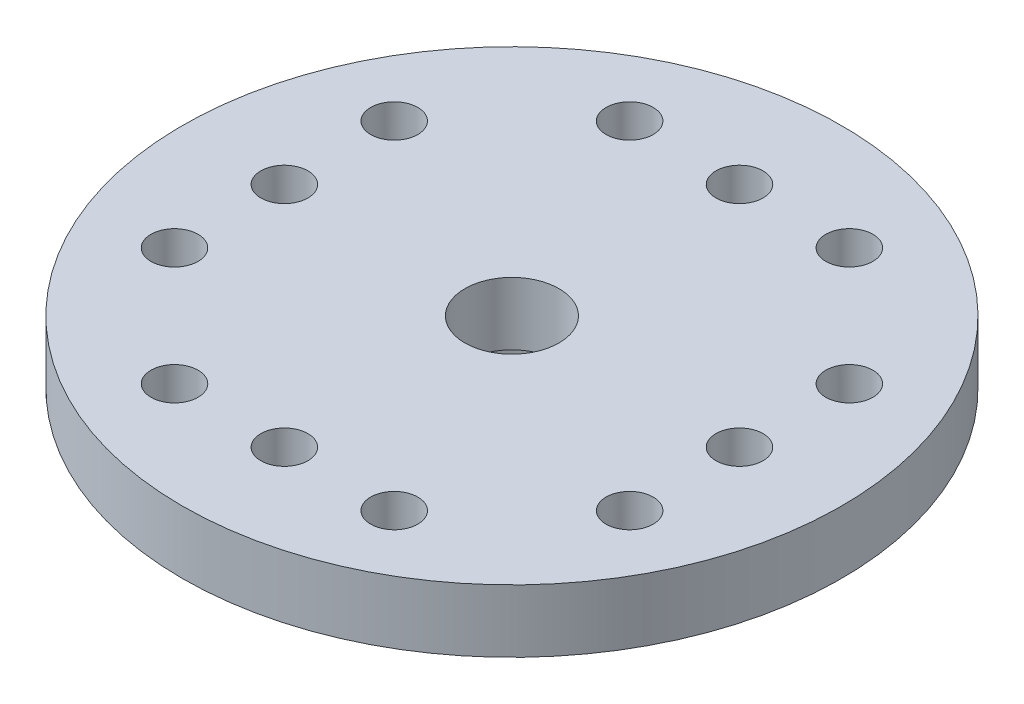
ISO-10303-21;
HEADER;
FILE_DESCRIPTION(('STEP AP214'),'2;1');
FILE_NAME('part.step','',(''),(''),'','','');
FILE_SCHEMA(('AUTOMOTIVE_DESIGN { 1 0 10303 214 1 1 1 1 }'));
ENDSEC;
DATA;
#1=APPLICATION_CONTEXT('core data for automotive mechanical design processes');
#2=APPLICATION_PROTOCOL_DEFINITION('international standard','automotive_design',2000,#1);
#3=PRODUCT_CONTEXT('',#1,'mechanical');
#4=PRODUCT('Part','Part','',(#3));
#5=PRODUCT_RELATED_PRODUCT_CATEGORY('part','',(#4));
#6=PRODUCT_DEFINITION_FORMATION('','',#4);
#7=PRODUCT_DEFINITION_CONTEXT('part definition',#1,'design');
#8=PRODUCT_DEFINITION('design','',#6,#7);
#9=PRODUCT_DEFINITION_SHAPE('','',#8);
#10=(LENGTH_UNIT() NAMED_UNIT(*) SI_UNIT(.MILLI.,.METRE.));
#11=(NAMED_UNIT(*) PLANE_ANGLE_UNIT() SI_UNIT($,.RADIAN.));
#12=(NAMED_UNIT(*) SI_UNIT($,.STERADIAN.) SOLID_ANGLE_UNIT());
#13=UNCERTAINTY_MEASURE_WITH_UNIT(LENGTH_MEASURE(1.E-05),#10,'distance_accuracy_value','');
#14=(GEOMETRIC_REPRESENTATION_CONTEXT(3) GLOBAL_UNCERTAINTY_ASSIGNED_CONTEXT((#13)) GLOBAL_UNIT_ASSIGNED_CONTEXT((#10,
#11,#12)) REPRESENTATION_CONTEXT('',''));
#15=CARTESIAN_POINT('',(0.,0.,0.));
#16=DIRECTION('',(0.,0.,1.));
#17=DIRECTION('',(1.,0.,0.));
#18=AXIS2_PLACEMENT_3D('',#15,#16,#17);
#19=CARTESIAN_POINT('',(0.,-2.,0.));
#20=DIRECTION('',(0.,1.,0.));
#21=DIRECTION('',(0.,0.,1.));
#22=AXIS2_PLACEMENT_3D('',#19,#20,#21);
#23=PLANE('',#22);
#24=CARTESIAN_POINT('',(3.5,-2.,7.25));
#25=DIRECTION('',(0.,1.,0.));
#26=DIRECTION('',(0.,0.,1.));
#27=AXIS2_PLACEMENT_3D('',#24,#25,#26);
#28=CIRCLE('',#27,0.750000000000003);
#29=CARTESIAN_POINT('',(3.5,-2.,8.));
#30=VERTEX_POINT('',#29);
#31=EDGE_CURVE('E147',#30,#30,#28,.T.);
#32=ORIENTED_EDGE('',*,*,#31,.T.);
#33=EDGE_LOOP('',(#32));
#34=FACE_BOUND('',#33,.T.);
#35=CARTESIAN_POINT('',(-3.5,-2.,7.25));
#36=DIRECTION('',(0.,1.,0.));
#37=DIRECTION('',(0.,0.,1.));
#38=AXIS2_PLACEMENT_3D('',#35,#36,#37);
#39=CIRCLE('',#38,0.75);
#40=CARTESIAN_POINT('',(-3.5,-2.,8.));
#41=VERTEX_POINT('',#40);
#42=EDGE_CURVE('E141',#41,#41,#39,.T.);
#43=ORIENTED_EDGE('',*,*,#42,.T.);
#44=EDGE_LOOP('',(#43));
#45=FACE_BOUND('',#44,.T.);
#46=CARTESIAN_POINT('',(0.,-2.,7.25));
#47=DIRECTION('',(0.,1.,0.));
#48=DIRECTION('',(0.,0.,1.));
#49=AXIS2_PLACEMENT_3D('',#46,#47,#48);
#50=CIRCLE('',#49,0.75);
#51=CARTESIAN_POINT('',(0.,-2.,8.));
#52=VERTEX_POINT('',#51);
#53=EDGE_CURVE('E135',#52,#52,#50,.T.);
#54=ORIENTED_EDGE('',*,*,#53,.T.);
#55=EDGE_LOOP('',(#54));
#56=FACE_BOUND('',#55,.T.);
#57=CARTESIAN_POINT('',(7.25,-2.,0.));
#58=DIRECTION('',(0.,1.,0.));
#59=DIRECTION('',(0.,0.,1.));
#60=AXIS2_PLACEMENT_3D('',#57,#58,#59);
#61=CIRCLE('',#60,0.750000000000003);
#62=CARTESIAN_POINT('',(7.25,-2.,0.749999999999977));
#63=VERTEX_POINT('',#62);
#64=EDGE_CURVE('E128',#63,#63,#61,.T.);
#65=ORIENTED_EDGE('',*,*,#64,.T.);
#66=EDGE_LOOP('',(#65));
#67=FACE_BOUND('',#66,.T.);
#68=CARTESIAN_POINT('',(7.24999999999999,-2.,-3.50000000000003));
#69=DIRECTION('',(0.,1.,0.));
#70=DIRECTION('',(0.,0.,1.));
#71=AXIS2_PLACEMENT_3D('',#68,#69,#70);
#72=CIRCLE('',#71,0.750000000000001);
#73=CARTESIAN_POINT('',(7.24999999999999,-2.,-2.75000000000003));
#74=VERTEX_POINT('',#73);
#75=EDGE_CURVE('E120',#74,#74,#72,.T.);
#76=ORIENTED_EDGE('',*,*,#75,.T.);
#77=EDGE_LOOP('',(#76));
#78=FACE_BOUND('',#77,.T.);
#79=CARTESIAN_POINT('',(7.25000000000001,-2.,3.49999999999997));
#80=DIRECTION('',(0.,1.,0.));
#81=DIRECTION('',(0.,0.,1.));
#82=AXIS2_PLACEMENT_3D('',#79,#80,#81);
#83=CIRCLE('',#82,0.75);
#84=CARTESIAN_POINT('',(7.25000000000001,-2.,4.24999999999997));
#85=VERTEX_POINT('',#84);
#86=EDGE_CURVE('E113',#85,#85,#83,.T.);
#87=ORIENTED_EDGE('',*,*,#86,.T.);
#88=EDGE_LOOP('',(#87));
#89=FACE_BOUND('',#88,.T.);
#90=CARTESIAN_POINT('',(-7.25,-2.,0.));
#91=DIRECTION('',(0.,1.,0.));
#92=DIRECTION('',(0.,0.,1.));
#93=AXIS2_PLACEMENT_3D('',#90,#91,#92);
#94=CIRCLE('',#93,0.750000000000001);
#95=CARTESIAN_POINT('',(-7.25,-2.,0.750000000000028));
#96=VERTEX_POINT('',#95);
#97=EDGE_CURVE('E107',#96,#96,#94,.T.);
#98=ORIENTED_EDGE('',*,*,#97,.T.);
#99=EDGE_LOOP('',(#98));
#100=FACE_BOUND('',#99,.T.);
#101=CARTESIAN_POINT('',(-7.24999999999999,-2.,3.50000000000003));
#102=DIRECTION('',(0.,1.,0.));
#103=DIRECTION('',(0.,0.,1.));
#104=AXIS2_PLACEMENT_3D('',#101,#102,#103);
#105=CIRCLE('',#104,0.75);
#106=CARTESIAN_POINT('',(-7.24999999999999,-2.,4.25000000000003));
#107=VERTEX_POINT('',#106);
#108=EDGE_CURVE('E101',#107,#107,#105,.T.);
#109=ORIENTED_EDGE('',*,*,#108,.T.);
#110=EDGE_LOOP('',(#109));
#111=FACE_BOUND('',#110,.T.);
#112=CARTESIAN_POINT('',(-7.25000000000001,-2.,-3.49999999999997));
#113=DIRECTION('',(0.,1.,0.));
#114=DIRECTION('',(0.,0.,1.));
#115=AXIS2_PLACEMENT_3D('',#112,#113,#114);
#116=CIRCLE('',#115,0.750000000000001);
#117=CARTESIAN_POINT('',(-7.25000000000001,-2.,-2.74999999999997));
#118=VERTEX_POINT('',#117);
#119=EDGE_CURVE('E95',#118,#118,#116,.T.);
#120=ORIENTED_EDGE('',*,*,#119,.T.);
#121=EDGE_LOOP('',(#120));
#122=FACE_BOUND('',#121,.T.);
#123=CARTESIAN_POINT('',(-3.5,-2.,-7.25));
#124=DIRECTION('',(0.,1.,0.));
#125=DIRECTION('',(0.,0.,1.));
#126=AXIS2_PLACEMENT_3D('',#123,#124,#125);
#127=CIRCLE('',#126,0.75);
#128=CARTESIAN_POINT('',(-3.5,-2.,-6.5));
#129=VERTEX_POINT('',#128);
#130=EDGE_CURVE('E89',#129,#129,#127,.T.);
#131=ORIENTED_EDGE('',*,*,#130,.T.);
#132=EDGE_LOOP('',(#131));
#133=FACE_BOUND('',#132,.T.);
#134=CARTESIAN_POINT('',(3.5,-2.,-7.25));
#135=DIRECTION('',(0.,1.,0.));
#136=DIRECTION('',(0.,0.,1.));
#137=AXIS2_PLACEMENT_3D('',#134,#135,#136);
#138=CIRCLE('',#137,0.75);
#139=CARTESIAN_POINT('',(3.5,-2.,-6.5));
#140=VERTEX_POINT('',#139);
#141=EDGE_CURVE('E83',#140,#140,#138,.T.);
#142=ORIENTED_EDGE('',*,*,#141,.T.);
#143=EDGE_LOOP('',(#142));
#144=FACE_BOUND('',#143,.T.);
#145=CARTESIAN_POINT('',(0.,-2.,-7.25));
#146=DIRECTION('',(0.,1.,0.));
#147=DIRECTION('',(0.,0.,1.));
#148=AXIS2_PLACEMENT_3D('',#145,#146,#147);
#149=CIRCLE('',#148,0.750000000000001);
#150=CARTESIAN_POINT('',(0.,-2.,-6.5));
#151=VERTEX_POINT('',#150);
#152=EDGE_CURVE('E74',#151,#151,#149,.T.);
#153=ORIENTED_EDGE('',*,*,#152,.T.);
#154=EDGE_LOOP('',(#153));
#155=FACE_BOUND('',#154,.T.);
#156=CARTESIAN_POINT('',(0.,-2.,0.));
#157=DIRECTION('',(0.,1.,0.));
#158=DIRECTION('',(0.,0.,1.));
#159=AXIS2_PLACEMENT_3D('',#156,#157,#158);
#160=CIRCLE('',#159,10.5);
#161=CARTESIAN_POINT('',(0.,-2.,10.5));
#162=VERTEX_POINT('',#161);
#163=EDGE_CURVE('E42',#162,#162,#160,.T.);
#164=ORIENTED_EDGE('',*,*,#163,.F.);
#165=EDGE_LOOP('',(#164));
#166=FACE_BOUND('',#165,.T.);
#167=CARTESIAN_POINT('',(0.,-2.,0.));
#168=DIRECTION('',(0.,1.,0.));
#169=DIRECTION('',(0.,0.,1.));
#170=AXIS2_PLACEMENT_3D('',#167,#168,#169);
#171=CIRCLE('',#170,4.4);
#172=CARTESIAN_POINT('',(0.,-2.,4.4));
#173=VERTEX_POINT('',#172);
#174=EDGE_CURVE('E10',#173,#173,#171,.F.);
#175=ORIENTED_EDGE('',*,*,#174,.F.);
#176=EDGE_LOOP('',(#175));
#177=FACE_BOUND('',#176,.T.);
#178=ADVANCED_FACE('F34',(#34,#45,#56,#67,#78,#89,#100,#111,#122,#133,#144,#155,#166,#177),#23,.F.);
#179=CARTESIAN_POINT('',(0.,-2.,0.));
#180=DIRECTION('',(0.,1.,0.));
#181=DIRECTION('',(0.,0.,1.));
#182=AXIS2_PLACEMENT_3D('',#179,#180,#181);
#183=CYLINDRICAL_SURFACE('',#182,10.5);
#184=ORIENTED_EDGE('',*,*,#163,.T.);
#185=EDGE_LOOP('',(#184));
#186=FACE_BOUND('',#185,.T.);
#187=CARTESIAN_POINT('',(0.,0.,0.));
#188=DIRECTION('',(0.,1.,0.));
#189=DIRECTION('',(0.,0.,1.));
#190=AXIS2_PLACEMENT_3D('',#187,#188,#189);
#191=CIRCLE('',#190,10.5);
#192=CARTESIAN_POINT('',(0.,0.,10.5));
#193=VERTEX_POINT('',#192);
#194=EDGE_CURVE('E49',#193,#193,#191,.T.);
#195=ORIENTED_EDGE('',*,*,#194,.F.);
#196=EDGE_LOOP('',(#195));
#197=FACE_BOUND('',#196,.T.);
#198=ADVANCED_FACE('F36',(#186,#197),#183,.T.);
#199=CARTESIAN_POINT('',(0.,-2.,0.));
#200=DIRECTION('',(0.,-1.,0.));
#201=DIRECTION('',(0.,0.,-1.));
#202=AXIS2_PLACEMENT_3D('',#199,#200,#201);
#203=CIRCLE('',#202,3.);
#204=CARTESIAN_POINT('',(0.,-2.,-3.));
#205=VERTEX_POINT('',#204);
#206=EDGE_CURVE('E71',#205,#205,#203,.T.);
#207=ORIENTED_EDGE('',*,*,#206,.T.);
#208=EDGE_LOOP('',(#207));
#209=FACE_BOUND('',#208,.T.);
#210=CARTESIAN_POINT('',(0.,-2.,0.));
#211=DIRECTION('',(0.,1.,0.));
#212=DIRECTION('',(0.,0.,1.));
#213=AXIS2_PLACEMENT_3D('',#210,#211,#212);
#214=CIRCLE('',#213,1.5);
#215=CARTESIAN_POINT('',(0.,-2.,1.5));
#216=VERTEX_POINT('',#215);
#217=EDGE_CURVE('E57',#216,#216,#214,.T.);
#218=ORIENTED_EDGE('',*,*,#217,.T.);
#219=EDGE_LOOP('',(#218));
#220=FACE_BOUND('',#219,.T.);
#221=ADVANCED_FACE('F162',(#209,#220),#23,.F.);
#222=CARTESIAN_POINT('',(0.,0.,0.));
#223=DIRECTION('',(0.,1.,0.));
#224=DIRECTION('',(0.,0.,1.));
#225=AXIS2_PLACEMENT_3D('',#222,#223,#224);
#226=PLANE('',#225);
#227=CARTESIAN_POINT('',(3.5,0.,7.25));
#228=DIRECTION('',(0.,1.,0.));
#229=DIRECTION('',(0.,0.,1.));
#230=AXIS2_PLACEMENT_3D('',#227,#228,#229);
#231=CIRCLE('',#230,0.750000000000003);
#232=CARTESIAN_POINT('',(3.5,0.,8.));
#233=VERTEX_POINT('',#232);
#234=EDGE_CURVE('E151',#233,#233,#231,.T.);
#235=ORIENTED_EDGE('',*,*,#234,.F.);
#236=EDGE_LOOP('',(#235));
#237=FACE_BOUND('',#236,.T.);
#238=CARTESIAN_POINT('',(-3.5,0.,7.25));
#239=DIRECTION('',(0.,1.,0.));
#240=DIRECTION('',(0.,0.,1.));
#241=AXIS2_PLACEMENT_3D('',#238,#239,#240);
#242=CIRCLE('',#241,0.75);
#243=CARTESIAN_POINT('',(-3.5,0.,8.));
#244=VERTEX_POINT('',#243);
#245=EDGE_CURVE('E144',#244,#244,#242,.T.);
#246=ORIENTED_EDGE('',*,*,#245,.F.);
#247=EDGE_LOOP('',(#246));
#248=FACE_BOUND('',#247,.T.);
#249=CARTESIAN_POINT('',(0.,0.,7.25));
#250=DIRECTION('',(0.,1.,0.));
#251=DIRECTION('',(0.,0.,1.));
#252=AXIS2_PLACEMENT_3D('',#249,#250,#251);
#253=CIRCLE('',#252,0.75);
#254=CARTESIAN_POINT('',(0.,0.,8.));
#255=VERTEX_POINT('',#254);
#256=EDGE_CURVE('E138',#255,#255,#253,.T.);
#257=ORIENTED_EDGE('',*,*,#256,.F.);
#258=EDGE_LOOP('',(#257));
#259=FACE_BOUND('',#258,.T.);
#260=CARTESIAN_POINT('',(7.25,0.,0.));
#261=DIRECTION('',(0.,1.,0.));
#262=DIRECTION('',(0.,0.,-1.));
#263=AXIS2_PLACEMENT_3D('',#260,#261,#262);
#264=CIRCLE('',#263,0.750000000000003);
#265=CARTESIAN_POINT('',(7.25,0.,-0.750000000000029));
#266=VERTEX_POINT('',#265);
#267=EDGE_CURVE('E131',#266,#266,#264,.T.);
#268=ORIENTED_EDGE('',*,*,#267,.F.);
#269=EDGE_LOOP('',(#268));
#270=FACE_BOUND('',#269,.T.);
#271=CARTESIAN_POINT('',(7.24999999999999,0.,-3.50000000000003));
#272=DIRECTION('',(0.,1.,0.));
#273=DIRECTION('',(0.,0.,-1.));
#274=AXIS2_PLACEMENT_3D('',#271,#272,#273);
#275=CIRCLE('',#274,0.750000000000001);
#276=CARTESIAN_POINT('',(7.24999999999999,0.,-4.25000000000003));
#277=VERTEX_POINT('',#276);
#278=EDGE_CURVE('E124',#277,#277,#275,.T.);
#279=ORIENTED_EDGE('',*,*,#278,.F.);
#280=EDGE_LOOP('',(#279));
#281=FACE_BOUND('',#280,.T.);
#282=CARTESIAN_POINT('',(7.25000000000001,0.,3.49999999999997));
#283=DIRECTION('',(0.,1.,0.));
#284=DIRECTION('',(0.,0.,-1.));
#285=AXIS2_PLACEMENT_3D('',#282,#283,#284);
#286=CIRCLE('',#285,0.75);
#287=CARTESIAN_POINT('',(7.25000000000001,0.,2.74999999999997));
#288=VERTEX_POINT('',#287);
#289=EDGE_CURVE('E116',#288,#288,#286,.T.);
#290=ORIENTED_EDGE('',*,*,#289,.F.);
#291=EDGE_LOOP('',(#290));
#292=FACE_BOUND('',#291,.T.);
#293=CARTESIAN_POINT('',(-7.25,0.,0.));
#294=DIRECTION('',(0.,1.,0.));
#295=DIRECTION('',(0.,0.,-1.));
#296=AXIS2_PLACEMENT_3D('',#293,#294,#295);
#297=CIRCLE('',#296,0.750000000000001);
#298=CARTESIAN_POINT('',(-7.25,0.,-0.749999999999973));
#299=VERTEX_POINT('',#298);
#300=EDGE_CURVE('E110',#299,#299,#297,.T.);
#301=ORIENTED_EDGE('',*,*,#300,.F.);
#302=EDGE_LOOP('',(#301));
#303=FACE_BOUND('',#302,.T.);
#304=CARTESIAN_POINT('',(-7.24999999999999,0.,3.50000000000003));
#305=DIRECTION('',(0.,1.,0.));
#306=DIRECTION('',(0.,0.,-1.));
#307=AXIS2_PLACEMENT_3D('',#304,#305,#306);
#308=CIRCLE('',#307,0.75);
#309=CARTESIAN_POINT('',(-7.24999999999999,0.,2.75000000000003));
#310=VERTEX_POINT('',#309);
#311=EDGE_CURVE('E104',#310,#310,#308,.T.);
#312=ORIENTED_EDGE('',*,*,#311,.F.);
#313=EDGE_LOOP('',(#312));
#314=FACE_BOUND('',#313,.T.);
#315=CARTESIAN_POINT('',(-7.25000000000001,0.,-3.49999999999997));
#316=DIRECTION('',(0.,1.,0.));
#317=DIRECTION('',(0.,0.,-1.));
#318=AXIS2_PLACEMENT_3D('',#315,#316,#317);
#319=CIRCLE('',#318,0.750000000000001);
#320=CARTESIAN_POINT('',(-7.25000000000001,0.,-4.24999999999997));
#321=VERTEX_POINT('',#320);
#322=EDGE_CURVE('E98',#321,#321,#319,.T.);
#323=ORIENTED_EDGE('',*,*,#322,.F.);
#324=EDGE_LOOP('',(#323));
#325=FACE_BOUND('',#324,.T.);
#326=CARTESIAN_POINT('',(-3.5,0.,-7.25));
#327=DIRECTION('',(0.,1.,0.));
#328=DIRECTION('',(0.,0.,1.));
#329=AXIS2_PLACEMENT_3D('',#326,#327,#328);
#330=CIRCLE('',#329,0.75);
#331=CARTESIAN_POINT('',(-3.5,0.,-6.5));
#332=VERTEX_POINT('',#331);
#333=EDGE_CURVE('E92',#332,#332,#330,.T.);
#334=ORIENTED_EDGE('',*,*,#333,.F.);
#335=EDGE_LOOP('',(#334));
#336=FACE_BOUND('',#335,.T.);
#337=CARTESIAN_POINT('',(3.5,0.,-7.25));
#338=DIRECTION('',(0.,1.,0.));
#339=DIRECTION('',(0.,0.,1.));
#340=AXIS2_PLACEMENT_3D('',#337,#338,#339);
#341=CIRCLE('',#340,0.75);
#342=CARTESIAN_POINT('',(3.5,0.,-6.5));
#343=VERTEX_POINT('',#342);
#344=EDGE_CURVE('E86',#343,#343,#341,.T.);
#345=ORIENTED_EDGE('',*,*,#344,.F.);
#346=EDGE_LOOP('',(#345));
#347=FACE_BOUND('',#346,.T.);
#348=CARTESIAN_POINT('',(0.,0.,-7.25));
#349=DIRECTION('',(0.,1.,0.));
#350=DIRECTION('',(0.,0.,1.));
#351=AXIS2_PLACEMENT_3D('',#348,#349,#350);
#352=CIRCLE('',#351,0.750000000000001);
#353=CARTESIAN_POINT('',(0.,0.,-6.5));
#354=VERTEX_POINT('',#353);
#355=EDGE_CURVE('E80',#354,#354,#352,.T.);
#356=ORIENTED_EDGE('',*,*,#355,.F.);
#357=EDGE_LOOP('',(#356));
#358=FACE_BOUND('',#357,.T.);
#359=CARTESIAN_POINT('',(0.,0.,0.));
#360=DIRECTION('',(0.,1.,0.));
#361=DIRECTION('',(0.,0.,1.));
#362=AXIS2_PLACEMENT_3D('',#359,#360,#361);
#363=CIRCLE('',#362,1.5);
#364=CARTESIAN_POINT('',(0.,0.,1.5));
#365=VERTEX_POINT('',#364);
#366=EDGE_CURVE('E59',#365,#365,#363,.T.);
#367=ORIENTED_EDGE('',*,*,#366,.F.);
#368=EDGE_LOOP('',(#367));
#369=FACE_BOUND('',#368,.T.);
#370=ORIENTED_EDGE('',*,*,#194,.T.);
#371=EDGE_LOOP('',(#370));
#372=FACE_BOUND('',#371,.T.);
#373=ADVANCED_FACE('F158',(#237,#248,#259,#270,#281,#292,#303,#314,#325,#336,#347,#358,#369,
#372),#226,.T.);
#374=CARTESIAN_POINT('',(0.,-2.,0.));
#375=DIRECTION('',(0.,1.,0.));
#376=DIRECTION('',(0.,0.,1.));
#377=AXIS2_PLACEMENT_3D('',#374,#375,#376);
#378=CYLINDRICAL_SURFACE('',#377,1.5);
#379=ORIENTED_EDGE('',*,*,#217,.F.);
#380=EDGE_LOOP('',(#379));
#381=FACE_BOUND('',#380,.T.);
#382=ORIENTED_EDGE('',*,*,#366,.T.);
#383=EDGE_LOOP('',(#382));
#384=FACE_BOUND('',#383,.T.);
#385=ADVANCED_FACE('F161',(#381,#384),#378,.F.);
#386=CARTESIAN_POINT('',(0.,-5.7,0.));
#387=DIRECTION('',(0.,-1.,0.));
#388=DIRECTION('',(0.,0.,-1.));
#389=AXIS2_PLACEMENT_3D('',#386,#387,#388);
#390=PLANE('',#389);
#391=CARTESIAN_POINT('',(0.,-5.7,0.));
#392=DIRECTION('',(0.,-1.,0.));
#393=DIRECTION('',(0.,0.,-1.));
#394=AXIS2_PLACEMENT_3D('',#391,#392,#393);
#395=CIRCLE('',#394,4.4);
#396=CARTESIAN_POINT('',(0.,-5.7,-4.4));
#397=VERTEX_POINT('',#396);
#398=EDGE_CURVE('E63',#397,#397,#395,.T.);
#399=ORIENTED_EDGE('',*,*,#398,.T.);
#400=EDGE_LOOP('',(#399));
#401=FACE_BOUND('',#400,.T.);
#402=CARTESIAN_POINT('',(0.,-5.7,0.));
#403=DIRECTION('',(0.,-1.,0.));
#404=DIRECTION('',(0.,0.,-1.));
#405=AXIS2_PLACEMENT_3D('',#402,#403,#404);
#406=CIRCLE('',#405,3.);
#407=CARTESIAN_POINT('',(0.,-5.7,-3.));
#408=VERTEX_POINT('',#407);
#409=EDGE_CURVE('E70',#408,#408,#406,.T.);
#410=ORIENTED_EDGE('',*,*,#409,.F.);
#411=EDGE_LOOP('',(#410));
#412=FACE_BOUND('',#411,.T.);
#413=ADVANCED_FACE('F203',(#401,#412),#390,.T.);
#414=CARTESIAN_POINT('',(0.,-5.7,0.));
#415=DIRECTION('',(0.,1.,0.));
#416=DIRECTION('',(0.,0.,1.));
#417=AXIS2_PLACEMENT_3D('',#414,#415,#416);
#418=CYLINDRICAL_SURFACE('',#417,4.4);
#419=ORIENTED_EDGE('',*,*,#398,.F.);
#420=EDGE_LOOP('',(#419));
#421=FACE_BOUND('',#420,.T.);
#422=ORIENTED_EDGE('',*,*,#174,.T.);
#423=EDGE_LOOP('',(#422));
#424=FACE_BOUND('',#423,.T.);
#425=ADVANCED_FACE('F205',(#421,#424),#418,.T.);
#426=CARTESIAN_POINT('',(0.,-5.7,0.));
#427=DIRECTION('',(0.,1.,0.));
#428=DIRECTION('',(0.,0.,1.));
#429=AXIS2_PLACEMENT_3D('',#426,#427,#428);
#430=CYLINDRICAL_SURFACE('',#429,3.);
#431=ORIENTED_EDGE('',*,*,#409,.T.);
#432=EDGE_LOOP('',(#431));
#433=FACE_BOUND('',#432,.T.);
#434=ORIENTED_EDGE('',*,*,#206,.F.);
#435=EDGE_LOOP('',(#434));
#436=FACE_BOUND('',#435,.T.);
#437=ADVANCED_FACE('F208',(#433,#436),#430,.F.);
#438=CARTESIAN_POINT('',(0.,-10.,-7.25));
#439=DIRECTION('',(0.,1.,0.));
#440=DIRECTION('',(0.,0.,1.));
#441=AXIS2_PLACEMENT_3D('',#438,#439,#440);
#442=CYLINDRICAL_SURFACE('',#441,0.750000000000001);
#443=ORIENTED_EDGE('',*,*,#355,.T.);
#444=EDGE_LOOP('',(#443));
#445=FACE_BOUND('',#444,.T.);
#446=ORIENTED_EDGE('',*,*,#152,.F.);
#447=EDGE_LOOP('',(#446));
#448=FACE_BOUND('',#447,.T.);
#449=ADVANCED_FACE('F215',(#445,#448),#442,.F.);
#450=CARTESIAN_POINT('',(3.5,-10.,-7.25));
#451=DIRECTION('',(0.,1.,0.));
#452=DIRECTION('',(0.,0.,1.));
#453=AXIS2_PLACEMENT_3D('',#450,#451,#452);
#454=CYLINDRICAL_SURFACE('',#453,0.75);
#455=ORIENTED_EDGE('',*,*,#344,.T.);
#456=EDGE_LOOP('',(#455));
#457=FACE_BOUND('',#456,.T.);
#458=ORIENTED_EDGE('',*,*,#141,.F.);
#459=EDGE_LOOP('',(#458));
#460=FACE_BOUND('',#459,.T.);
#461=ADVANCED_FACE('F219',(#457,#460),#454,.F.);
#462=CARTESIAN_POINT('',(-3.5,-10.,-7.25));
#463=DIRECTION('',(0.,1.,0.));
#464=DIRECTION('',(0.,0.,1.));
#465=AXIS2_PLACEMENT_3D('',#462,#463,#464);
#466=CYLINDRICAL_SURFACE('',#465,0.75);
#467=ORIENTED_EDGE('',*,*,#333,.T.);
#468=EDGE_LOOP('',(#467));
#469=FACE_BOUND('',#468,.T.);
#470=ORIENTED_EDGE('',*,*,#130,.F.);
#471=EDGE_LOOP('',(#470));
#472=FACE_BOUND('',#471,.T.);
#473=ADVANCED_FACE('F223',(#469,#472),#466,.F.);
#474=CARTESIAN_POINT('',(-7.25000000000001,-10.,-3.49999999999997));
#475=DIRECTION('',(0.,1.,0.));
#476=DIRECTION('',(0.,0.,1.));
#477=AXIS2_PLACEMENT_3D('',#474,#475,#476);
#478=CYLINDRICAL_SURFACE('',#477,0.750000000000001);
#479=ORIENTED_EDGE('',*,*,#322,.T.);
#480=EDGE_LOOP('',(#479));
#481=FACE_BOUND('',#480,.T.);
#482=ORIENTED_EDGE('',*,*,#119,.F.);
#483=EDGE_LOOP('',(#482));
#484=FACE_BOUND('',#483,.T.);
#485=ADVANCED_FACE('F227',(#481,#484),#478,.F.);
#486=CARTESIAN_POINT('',(-7.24999999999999,-10.,3.50000000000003));
#487=DIRECTION('',(0.,1.,0.));
#488=DIRECTION('',(0.,0.,1.));
#489=AXIS2_PLACEMENT_3D('',#486,#487,#488);
#490=CYLINDRICAL_SURFACE('',#489,0.75);
#491=ORIENTED_EDGE('',*,*,#311,.T.);
#492=EDGE_LOOP('',(#491));
#493=FACE_BOUND('',#492,.T.);
#494=ORIENTED_EDGE('',*,*,#108,.F.);
#495=EDGE_LOOP('',(#494));
#496=FACE_BOUND('',#495,.T.);
#497=ADVANCED_FACE('F231',(#493,#496),#490,.F.);
#498=CARTESIAN_POINT('',(-7.25,-10.,0.));
#499=DIRECTION('',(0.,1.,0.));
#500=DIRECTION('',(0.,0.,1.));
#501=AXIS2_PLACEMENT_3D('',#498,#499,#500);
#502=CYLINDRICAL_SURFACE('',#501,0.750000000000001);
#503=ORIENTED_EDGE('',*,*,#300,.T.);
#504=EDGE_LOOP('',(#503));
#505=FACE_BOUND('',#504,.T.);
#506=ORIENTED_EDGE('',*,*,#97,.F.);
#507=EDGE_LOOP('',(#506));
#508=FACE_BOUND('',#507,.T.);
#509=ADVANCED_FACE('F235',(#505,#508),#502,.F.);
#510=CARTESIAN_POINT('',(7.25000000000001,-10.,3.49999999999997));
#511=DIRECTION('',(0.,1.,0.));
#512=DIRECTION('',(0.,0.,1.));
#513=AXIS2_PLACEMENT_3D('',#510,#511,#512);
#514=CYLINDRICAL_SURFACE('',#513,0.75);
#515=ORIENTED_EDGE('',*,*,#289,.T.);
#516=EDGE_LOOP('',(#515));
#517=FACE_BOUND('',#516,.T.);
#518=ORIENTED_EDGE('',*,*,#86,.F.);
#519=EDGE_LOOP('',(#518));
#520=FACE_BOUND('',#519,.T.);
#521=ADVANCED_FACE('F239',(#517,#520),#514,.F.);
#522=CARTESIAN_POINT('',(7.24999999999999,-10.,-3.50000000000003));
#523=DIRECTION('',(0.,1.,0.));
#524=DIRECTION('',(0.,0.,1.));
#525=AXIS2_PLACEMENT_3D('',#522,#523,#524);
#526=CYLINDRICAL_SURFACE('',#525,0.750000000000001);
#527=ORIENTED_EDGE('',*,*,#278,.T.);
#528=EDGE_LOOP('',(#527));
#529=FACE_BOUND('',#528,.T.);
#530=ORIENTED_EDGE('',*,*,#75,.F.);
#531=EDGE_LOOP('',(#530));
#532=FACE_BOUND('',#531,.T.);
#533=ADVANCED_FACE('F243',(#529,#532),#526,.F.);
#534=CARTESIAN_POINT('',(7.25,-10.,0.));
#535=DIRECTION('',(0.,1.,0.));
#536=DIRECTION('',(0.,0.,1.));
#537=AXIS2_PLACEMENT_3D('',#534,#535,#536);
#538=CYLINDRICAL_SURFACE('',#537,0.750000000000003);
#539=ORIENTED_EDGE('',*,*,#267,.T.);
#540=EDGE_LOOP('',(#539));
#541=FACE_BOUND('',#540,.T.);
#542=ORIENTED_EDGE('',*,*,#64,.F.);
#543=EDGE_LOOP('',(#542));
#544=FACE_BOUND('',#543,.T.);
#545=ADVANCED_FACE('F247',(#541,#544),#538,.F.);
#546=CARTESIAN_POINT('',(0.,-10.,7.25));
#547=DIRECTION('',(0.,1.,0.));
#548=DIRECTION('',(0.,0.,1.));
#549=AXIS2_PLACEMENT_3D('',#546,#547,#548);
#550=CYLINDRICAL_SURFACE('',#549,0.75);
#551=ORIENTED_EDGE('',*,*,#256,.T.);
#552=EDGE_LOOP('',(#551));
#553=FACE_BOUND('',#552,.T.);
#554=ORIENTED_EDGE('',*,*,#53,.F.);
#555=EDGE_LOOP('',(#554));
#556=FACE_BOUND('',#555,.T.);
#557=ADVANCED_FACE('F251',(#553,#556),#550,.F.);
#558=CARTESIAN_POINT('',(-3.5,-10.,7.25));
#559=DIRECTION('',(0.,1.,0.));
#560=DIRECTION('',(0.,0.,1.));
#561=AXIS2_PLACEMENT_3D('',#558,#559,#560);
#562=CYLINDRICAL_SURFACE('',#561,0.75);
#563=ORIENTED_EDGE('',*,*,#245,.T.);
#564=EDGE_LOOP('',(#563));
#565=FACE_BOUND('',#564,.T.);
#566=ORIENTED_EDGE('',*,*,#42,.F.);
#567=EDGE_LOOP('',(#566));
#568=FACE_BOUND('',#567,.T.);
#569=ADVANCED_FACE('F255',(#565,#568),#562,.F.);
#570=CARTESIAN_POINT('',(3.5,-10.,7.25));
#571=DIRECTION('',(0.,1.,0.));
#572=DIRECTION('',(0.,0.,1.));
#573=AXIS2_PLACEMENT_3D('',#570,#571,#572);
#574=CYLINDRICAL_SURFACE('',#573,0.750000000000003);
#575=ORIENTED_EDGE('',*,*,#234,.T.);
#576=EDGE_LOOP('',(#575));
#577=FACE_BOUND('',#576,.T.);
#578=ORIENTED_EDGE('',*,*,#31,.F.);
#579=EDGE_LOOP('',(#578));
#580=FACE_BOUND('',#579,.T.);
#581=ADVANCED_FACE('F155',(#577,#580),#574,.F.);
#582=CLOSED_SHELL('',(#178,#198,#221,#373,#385,#413,#425,#437,#449,#461,#473,#485,#497,#509,
#521,#533,#545,#557,#569,#581));
#583=MANIFOLD_SOLID_BREP('B2',#582);
#584=ADVANCED_BREP_SHAPE_REPRESENTATION('',(#18,#583),#14);
#585=SHAPE_DEFINITION_REPRESENTATION(#9,#584);
ENDSEC;
END-ISO-10303-21;
